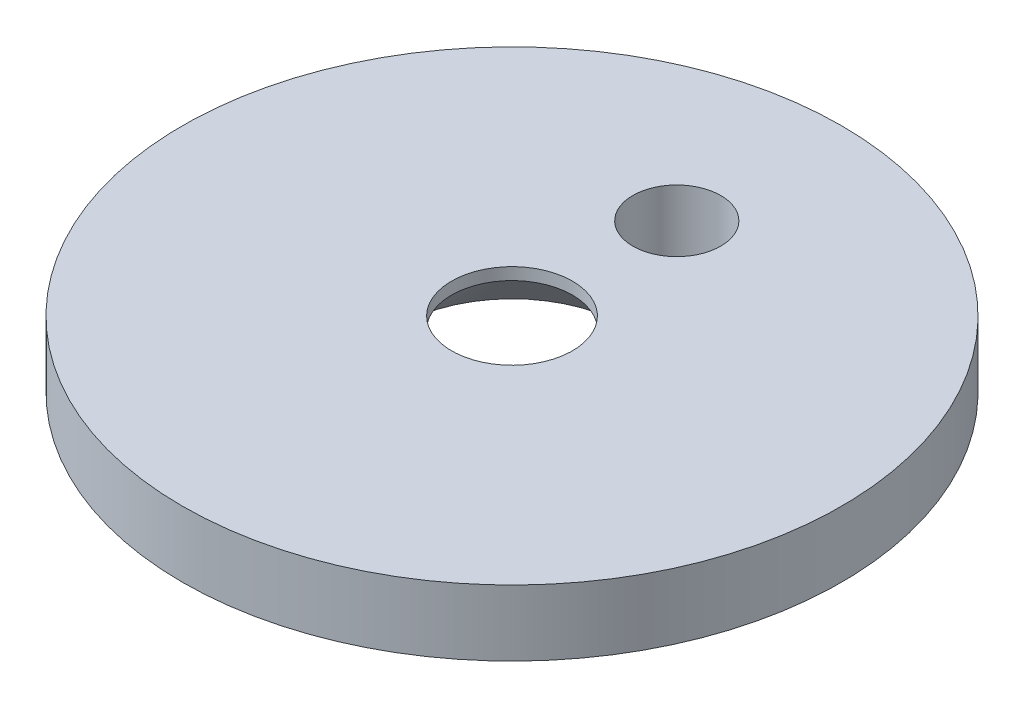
ISO-10303-21;
HEADER;
FILE_DESCRIPTION(('STEP AP214'),'2;1');
FILE_NAME('part.step','',(''),(''),'','','');
FILE_SCHEMA(('AUTOMOTIVE_DESIGN { 1 0 10303 214 1 1 1 1 }'));
ENDSEC;
DATA;
#1=APPLICATION_CONTEXT('core data for automotive mechanical design processes');
#2=APPLICATION_PROTOCOL_DEFINITION('international standard','automotive_design',2000,#1);
#3=PRODUCT_CONTEXT('',#1,'mechanical');
#4=PRODUCT('Part','Part','',(#3));
#5=PRODUCT_RELATED_PRODUCT_CATEGORY('part','',(#4));
#6=PRODUCT_DEFINITION_FORMATION('','',#4);
#7=PRODUCT_DEFINITION_CONTEXT('part definition',#1,'design');
#8=PRODUCT_DEFINITION('design','',#6,#7);
#9=PRODUCT_DEFINITION_SHAPE('','',#8);
#10=(LENGTH_UNIT() NAMED_UNIT(*) SI_UNIT(.MILLI.,.METRE.));
#11=(NAMED_UNIT(*) PLANE_ANGLE_UNIT() SI_UNIT($,.RADIAN.));
#12=(NAMED_UNIT(*) SI_UNIT($,.STERADIAN.) SOLID_ANGLE_UNIT());
#13=UNCERTAINTY_MEASURE_WITH_UNIT(LENGTH_MEASURE(1.E-05),#10,'distance_accuracy_value','');
#14=(GEOMETRIC_REPRESENTATION_CONTEXT(3) GLOBAL_UNCERTAINTY_ASSIGNED_CONTEXT((#13)) GLOBAL_UNIT_ASSIGNED_CONTEXT((#10,
#11,#12)) REPRESENTATION_CONTEXT('',''));
#15=CARTESIAN_POINT('',(0.,0.,0.));
#16=DIRECTION('',(0.,0.,1.));
#17=DIRECTION('',(1.,0.,0.));
#18=AXIS2_PLACEMENT_3D('',#15,#16,#17);
#19=CARTESIAN_POINT('',(0.,3.,0.));
#20=DIRECTION('',(0.,1.,0.));
#21=DIRECTION('',(0.,0.,1.));
#22=AXIS2_PLACEMENT_3D('',#19,#20,#21);
#23=PLANE('',#22);
#24=CARTESIAN_POINT('',(0.,3.,0.));
#25=DIRECTION('',(0.,-1.,0.));
#26=DIRECTION('',(0.,0.,-1.));
#27=AXIS2_PLACEMENT_3D('',#24,#25,#26);
#28=CIRCLE('',#27,2.75);
#29=CARTESIAN_POINT('',(0.,3.,-2.75));
#30=VERTEX_POINT('',#29);
#31=EDGE_CURVE('E47',#30,#30,#28,.T.);
#32=ORIENTED_EDGE('',*,*,#31,.T.);
#33=EDGE_LOOP('',(#32));
#34=FACE_BOUND('',#33,.T.);
#35=CARTESIAN_POINT('',(0.,3.,0.));
#36=DIRECTION('',(0.,1.,0.));
#37=DIRECTION('',(0.,0.,1.));
#38=AXIS2_PLACEMENT_3D('',#35,#36,#37);
#39=CIRCLE('',#38,15.);
#40=CARTESIAN_POINT('',(0.,3.,15.));
#41=VERTEX_POINT('',#40);
#42=EDGE_CURVE('E10',#41,#41,#39,.T.);
#43=ORIENTED_EDGE('',*,*,#42,.T.);
#44=EDGE_LOOP('',(#43));
#45=FACE_BOUND('',#44,.T.);
#46=CARTESIAN_POINT('',(0.,3.,-7.5));
#47=DIRECTION('',(0.,1.,0.));
#48=DIRECTION('',(0.,0.,1.));
#49=AXIS2_PLACEMENT_3D('',#46,#47,#48);
#50=CIRCLE('',#49,2.);
#51=CARTESIAN_POINT('',(0.,3.,-5.5));
#52=VERTEX_POINT('',#51);
#53=EDGE_CURVE('E42',#52,#52,#50,.T.);
#54=ORIENTED_EDGE('',*,*,#53,.F.);
#55=EDGE_LOOP('',(#54));
#56=FACE_BOUND('',#55,.T.);
#57=ADVANCED_FACE('F31',(#34,#45,#56),#23,.T.);
#58=CARTESIAN_POINT('',(0.,0.,0.));
#59=DIRECTION('',(0.,1.,0.));
#60=DIRECTION('',(0.,0.,1.));
#61=AXIS2_PLACEMENT_3D('',#58,#59,#60);
#62=PLANE('',#61);
#63=CARTESIAN_POINT('',(0.,0.,0.));
#64=DIRECTION('',(0.,-1.,0.));
#65=DIRECTION('',(0.,0.,-1.));
#66=AXIS2_PLACEMENT_3D('',#63,#64,#65);
#67=CIRCLE('',#66,5.2);
#68=CARTESIAN_POINT('',(0.,0.,-5.2));
#69=VERTEX_POINT('',#68);
#70=EDGE_CURVE('E55',#69,#69,#67,.T.);
#71=ORIENTED_EDGE('',*,*,#70,.F.);
#72=EDGE_LOOP('',(#71));
#73=FACE_BOUND('',#72,.T.);
#74=CARTESIAN_POINT('',(0.,0.,0.));
#75=DIRECTION('',(0.,1.,0.));
#76=DIRECTION('',(0.,0.,1.));
#77=AXIS2_PLACEMENT_3D('',#74,#75,#76);
#78=CIRCLE('',#77,15.);
#79=CARTESIAN_POINT('',(0.,0.,15.));
#80=VERTEX_POINT('',#79);
#81=EDGE_CURVE('E35',#80,#80,#78,.T.);
#82=ORIENTED_EDGE('',*,*,#81,.F.);
#83=EDGE_LOOP('',(#82));
#84=FACE_BOUND('',#83,.T.);
#85=CARTESIAN_POINT('',(0.,0.,-7.5));
#86=DIRECTION('',(0.,1.,0.));
#87=DIRECTION('',(0.,0.,1.));
#88=AXIS2_PLACEMENT_3D('',#85,#86,#87);
#89=CIRCLE('',#88,2.);
#90=CARTESIAN_POINT('',(0.,0.,-5.5));
#91=VERTEX_POINT('',#90);
#92=EDGE_CURVE('E44',#91,#91,#89,.T.);
#93=ORIENTED_EDGE('',*,*,#92,.T.);
#94=EDGE_LOOP('',(#93));
#95=FACE_BOUND('',#94,.T.);
#96=ADVANCED_FACE('F61',(#73,#84,#95),#62,.F.);
#97=CARTESIAN_POINT('',(0.,3.,0.));
#98=DIRECTION('',(0.,-1.,0.));
#99=DIRECTION('',(0.,0.,-1.));
#100=AXIS2_PLACEMENT_3D('',#97,#98,#99);
#101=CYLINDRICAL_SURFACE('',#100,15.);
#102=ORIENTED_EDGE('',*,*,#42,.F.);
#103=EDGE_LOOP('',(#102));
#104=FACE_BOUND('',#103,.T.);
#105=ORIENTED_EDGE('',*,*,#81,.T.);
#106=EDGE_LOOP('',(#105));
#107=FACE_BOUND('',#106,.T.);
#108=ADVANCED_FACE('F33',(#104,#107),#101,.T.);
#109=CARTESIAN_POINT('',(0.,3.,-7.5));
#110=DIRECTION('',(0.,-1.,0.));
#111=DIRECTION('',(0.,0.,-1.));
#112=AXIS2_PLACEMENT_3D('',#109,#110,#111);
#113=CYLINDRICAL_SURFACE('',#112,2.);
#114=ORIENTED_EDGE('',*,*,#53,.T.);
#115=EDGE_LOOP('',(#114));
#116=FACE_BOUND('',#115,.T.);
#117=ORIENTED_EDGE('',*,*,#92,.F.);
#118=EDGE_LOOP('',(#117));
#119=FACE_BOUND('',#118,.T.);
#120=ADVANCED_FACE('F68',(#116,#119),#113,.F.);
#121=CARTESIAN_POINT('',(0.,0.,0.));
#122=DIRECTION('',(0.,-1.,0.));
#123=DIRECTION('',(0.,0.,-1.));
#124=AXIS2_PLACEMENT_3D('',#121,#122,#123);
#125=CYLINDRICAL_SURFACE('',#124,2.75);
#126=ORIENTED_EDGE('',*,*,#31,.F.);
#127=EDGE_LOOP('',(#126));
#128=FACE_BOUND('',#127,.T.);
#129=CARTESIAN_POINT('',(0.,2.45,0.));
#130=DIRECTION('',(0.,-1.,0.));
#131=DIRECTION('',(0.,0.,-1.));
#132=AXIS2_PLACEMENT_3D('',#129,#130,#131);
#133=CIRCLE('',#132,2.75);
#134=CARTESIAN_POINT('',(0.,2.45,-2.75));
#135=VERTEX_POINT('',#134);
#136=EDGE_CURVE('E52',#135,#135,#133,.T.);
#137=ORIENTED_EDGE('',*,*,#136,.T.);
#138=EDGE_LOOP('',(#137));
#139=FACE_BOUND('',#138,.T.);
#140=ADVANCED_FACE('F70',(#128,#139),#125,.F.);
#141=CARTESIAN_POINT('',(0.,0.,0.));
#142=DIRECTION('',(0.,-1.,0.));
#143=DIRECTION('',(0.,0.,-1.));
#144=AXIS2_PLACEMENT_3D('',#141,#142,#143);
#145=CONICAL_SURFACE('',#144,5.2,0.785398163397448);
#146=ORIENTED_EDGE('',*,*,#136,.F.);
#147=EDGE_LOOP('',(#146));
#148=FACE_BOUND('',#147,.T.);
#149=ORIENTED_EDGE('',*,*,#70,.T.);
#150=EDGE_LOOP('',(#149));
#151=FACE_BOUND('',#150,.T.);
#152=ADVANCED_FACE('F59',(#148,#151),#145,.F.);
#153=CLOSED_SHELL('',(#57,#96,#108,#120,#140,#152));
#154=MANIFOLD_SOLID_BREP('B2',#153);
#155=ADVANCED_BREP_SHAPE_REPRESENTATION('',(#18,#154),#14);
#156=SHAPE_DEFINITION_REPRESENTATION(#9,#155);
ENDSEC;
END-ISO-10303-21;
